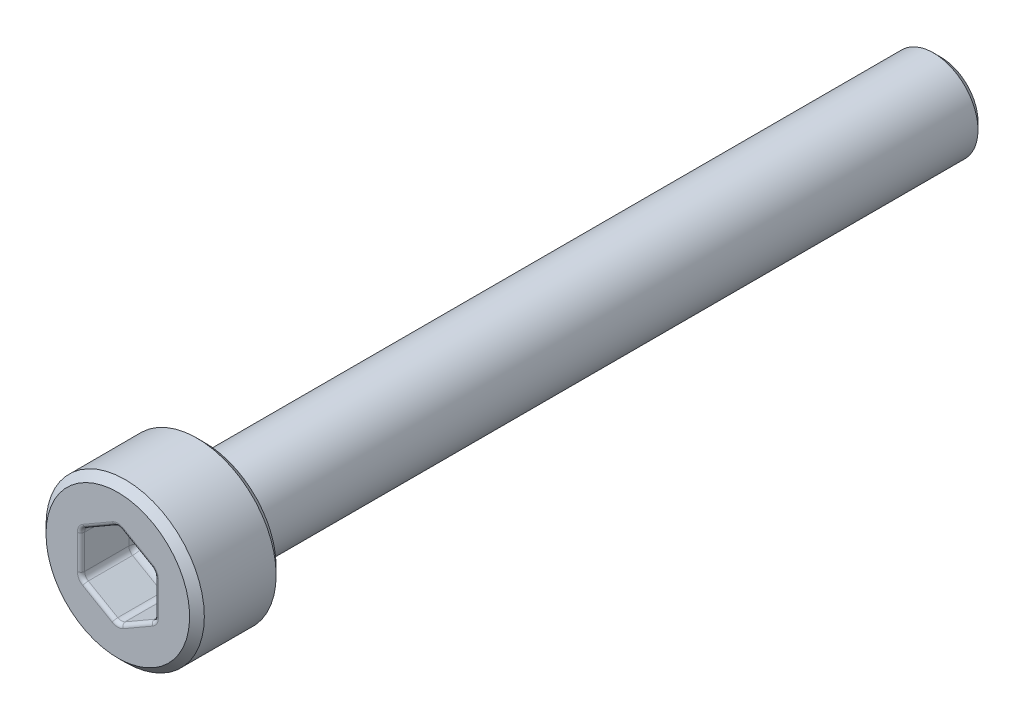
ISO-10303-21;
HEADER;
FILE_DESCRIPTION(('STEP AP214'),'2;1');
FILE_NAME('part.step','',(''),(''),'','','');
FILE_SCHEMA(('AUTOMOTIVE_DESIGN { 1 0 10303 214 1 1 1 1 }'));
ENDSEC;
DATA;
#1=APPLICATION_CONTEXT('core data for automotive mechanical design processes');
#2=APPLICATION_PROTOCOL_DEFINITION('international standard','automotive_design',2000,#1);
#3=PRODUCT_CONTEXT('',#1,'mechanical');
#4=PRODUCT('Part','Part','',(#3));
#5=PRODUCT_RELATED_PRODUCT_CATEGORY('part','',(#4));
#6=PRODUCT_DEFINITION_FORMATION('','',#4);
#7=PRODUCT_DEFINITION_CONTEXT('part definition',#1,'design');
#8=PRODUCT_DEFINITION('design','',#6,#7);
#9=PRODUCT_DEFINITION_SHAPE('','',#8);
#10=(LENGTH_UNIT() NAMED_UNIT(*) SI_UNIT(.MILLI.,.METRE.));
#11=(NAMED_UNIT(*) PLANE_ANGLE_UNIT() SI_UNIT($,.RADIAN.));
#12=(NAMED_UNIT(*) SI_UNIT($,.STERADIAN.) SOLID_ANGLE_UNIT());
#13=UNCERTAINTY_MEASURE_WITH_UNIT(LENGTH_MEASURE(1.E-05),#10,'distance_accuracy_value','');
#14=(GEOMETRIC_REPRESENTATION_CONTEXT(3) GLOBAL_UNCERTAINTY_ASSIGNED_CONTEXT((#13)) GLOBAL_UNIT_ASSIGNED_CONTEXT((#10,
#11,#12)) REPRESENTATION_CONTEXT('',''));
#15=CARTESIAN_POINT('',(0.,0.,0.));
#16=DIRECTION('',(0.,0.,1.));
#17=DIRECTION('',(1.,0.,0.));
#18=AXIS2_PLACEMENT_3D('',#15,#16,#17);
#19=CARTESIAN_POINT('',(0.,0.,2.35));
#20=DIRECTION('',(0.,0.,-1.));
#21=DIRECTION('',(-1.,0.,0.));
#22=AXIS2_PLACEMENT_3D('',#19,#20,#21);
#23=PLANE('',#22);
#24=DIRECTION('',(0.,1.,0.));
#25=VECTOR('',#24,1.);
#26=CARTESIAN_POINT('',(1.1,0.,2.35));
#27=LINE('',#26,#25);
#28=CARTESIAN_POINT('',(1.1,0.4618802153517,2.35));
#29=VERTEX_POINT('',#28);
#30=CARTESIAN_POINT('',(1.1,-0.461880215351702,2.35));
#31=VERTEX_POINT('',#30);
#32=EDGE_CURVE('E264',#29,#31,#27,.F.);
#33=ORIENTED_EDGE('',*,*,#32,.T.);
#34=CARTESIAN_POINT('',(0.8,-0.461880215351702,2.35));
#35=DIRECTION('',(0.,0.,-1.));
#36=DIRECTION('',(-1.,0.,0.));
#37=AXIS2_PLACEMENT_3D('',#34,#35,#36);
#38=CIRCLE('',#37,0.3);
#39=CARTESIAN_POINT('',(0.95,-0.721687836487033,2.35));
#40=VERTEX_POINT('',#39);
#41=EDGE_CURVE('E329',#31,#40,#38,.T.);
#42=ORIENTED_EDGE('',*,*,#41,.T.);
#43=DIRECTION('',(0.866025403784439,0.499999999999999,0.));
#44=VECTOR('',#43,1.);
#45=CARTESIAN_POINT('',(0.549999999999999,-0.952627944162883,2.35));
#46=LINE('',#45,#44);
#47=CARTESIAN_POINT('',(0.149999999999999,-1.18356805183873,2.35));
#48=VERTEX_POINT('',#47);
#49=EDGE_CURVE('E327',#40,#48,#46,.F.);
#50=ORIENTED_EDGE('',*,*,#49,.T.);
#51=CARTESIAN_POINT('',(0.,-0.923760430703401,2.35));
#52=DIRECTION('',(0.,0.,-1.));
#53=DIRECTION('',(-1.,0.,0.));
#54=AXIS2_PLACEMENT_3D('',#51,#52,#53);
#55=CIRCLE('',#54,0.3);
#56=CARTESIAN_POINT('',(-0.150000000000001,-1.18356805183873,2.35));
#57=VERTEX_POINT('',#56);
#58=EDGE_CURVE('E325',#48,#57,#55,.T.);
#59=ORIENTED_EDGE('',*,*,#58,.T.);
#60=DIRECTION('',(0.866025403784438,-0.500000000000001,0.));
#61=VECTOR('',#60,1.);
#62=CARTESIAN_POINT('',(-0.550000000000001,-0.952627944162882,2.35));
#63=LINE('',#62,#61);
#64=CARTESIAN_POINT('',(-0.950000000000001,-0.721687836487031,2.35));
#65=VERTEX_POINT('',#64);
#66=EDGE_CURVE('E323',#57,#65,#63,.F.);
#67=ORIENTED_EDGE('',*,*,#66,.T.);
#68=CARTESIAN_POINT('',(-0.800000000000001,-0.4618802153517,2.35));
#69=DIRECTION('',(0.,0.,-1.));
#70=DIRECTION('',(-1.,0.,0.));
#71=AXIS2_PLACEMENT_3D('',#68,#69,#70);
#72=CIRCLE('',#71,0.3);
#73=CARTESIAN_POINT('',(-1.1,-0.4618802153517,2.35));
#74=VERTEX_POINT('',#73);
#75=EDGE_CURVE('E321',#65,#74,#72,.T.);
#76=ORIENTED_EDGE('',*,*,#75,.T.);
#77=DIRECTION('',(0.,-1.,0.));
#78=VECTOR('',#77,1.);
#79=CARTESIAN_POINT('',(-1.1,0.,2.35));
#80=LINE('',#79,#78);
#81=CARTESIAN_POINT('',(-1.1,0.461880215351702,2.35));
#82=VERTEX_POINT('',#81);
#83=EDGE_CURVE('E319',#74,#82,#80,.F.);
#84=ORIENTED_EDGE('',*,*,#83,.T.);
#85=CARTESIAN_POINT('',(-0.8,0.461880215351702,2.35));
#86=DIRECTION('',(0.,0.,-1.));
#87=DIRECTION('',(-1.,0.,0.));
#88=AXIS2_PLACEMENT_3D('',#85,#86,#87);
#89=CIRCLE('',#88,0.3);
#90=CARTESIAN_POINT('',(-0.95,0.721687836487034,2.35));
#91=VERTEX_POINT('',#90);
#92=EDGE_CURVE('E317',#82,#91,#89,.T.);
#93=ORIENTED_EDGE('',*,*,#92,.T.);
#94=DIRECTION('',(-0.866025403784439,-0.499999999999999,0.));
#95=VECTOR('',#94,1.);
#96=CARTESIAN_POINT('',(-0.549999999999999,0.952627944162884,2.35));
#97=LINE('',#96,#95);
#98=CARTESIAN_POINT('',(-0.149999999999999,1.18356805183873,2.35));
#99=VERTEX_POINT('',#98);
#100=EDGE_CURVE('E315',#91,#99,#97,.F.);
#101=ORIENTED_EDGE('',*,*,#100,.T.);
#102=CARTESIAN_POINT('',(0.,0.923760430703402,2.35));
#103=DIRECTION('',(0.,0.,-1.));
#104=DIRECTION('',(-1.,0.,0.));
#105=AXIS2_PLACEMENT_3D('',#102,#103,#104);
#106=CIRCLE('',#105,0.3);
#107=CARTESIAN_POINT('',(0.150000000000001,1.18356805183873,2.35));
#108=VERTEX_POINT('',#107);
#109=EDGE_CURVE('E313',#99,#108,#106,.T.);
#110=ORIENTED_EDGE('',*,*,#109,.T.);
#111=DIRECTION('',(-0.866025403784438,0.500000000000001,0.));
#112=VECTOR('',#111,1.);
#113=CARTESIAN_POINT('',(0.550000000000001,0.952627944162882,2.35));
#114=LINE('',#113,#112);
#115=CARTESIAN_POINT('',(0.950000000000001,0.721687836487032,2.35));
#116=VERTEX_POINT('',#115);
#117=EDGE_CURVE('E311',#108,#116,#114,.F.);
#118=ORIENTED_EDGE('',*,*,#117,.T.);
#119=CARTESIAN_POINT('',(0.8,0.4618802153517,2.35));
#120=DIRECTION('',(0.,0.,-1.));
#121=DIRECTION('',(-1.,0.,0.));
#122=AXIS2_PLACEMENT_3D('',#119,#120,#121);
#123=CIRCLE('',#122,0.3);
#124=EDGE_CURVE('E309',#116,#29,#123,.T.);
#125=ORIENTED_EDGE('',*,*,#124,.T.);
#126=EDGE_LOOP('',(#33,#42,#50,#59,#67,#76,#84,#93,#101,#110,#118,#125));
#127=FACE_BOUND('',#126,.T.);
#128=CARTESIAN_POINT('',(0.,0.,2.35));
#129=DIRECTION('',(0.,0.,-1.));
#130=DIRECTION('',(-1.,0.,0.));
#131=AXIS2_PLACEMENT_3D('',#128,#129,#130);
#132=CIRCLE('',#131,1.95);
#133=CARTESIAN_POINT('',(-1.95,0.,2.35));
#134=VERTEX_POINT('',#133);
#135=EDGE_CURVE('E307',#134,#134,#132,.F.);
#136=ORIENTED_EDGE('',*,*,#135,.T.);
#137=EDGE_LOOP('',(#136));
#138=FACE_BOUND('',#137,.T.);
#139=ADVANCED_FACE('F35',(#127,#138),#23,.F.);
#140=CARTESIAN_POINT('',(0.,0.,21.9198795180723));
#141=DIRECTION('',(0.,0.,1.));
#142=DIRECTION('',(1.,0.,0.));
#143=AXIS2_PLACEMENT_3D('',#140,#141,#142);
#144=CYLINDRICAL_SURFACE('',#143,2.15);
#145=CARTESIAN_POINT('',(0.,0.,2.15));
#146=DIRECTION('',(0.,0.,-1.));
#147=DIRECTION('',(-1.,0.,0.));
#148=AXIS2_PLACEMENT_3D('',#145,#146,#147);
#149=CIRCLE('',#148,2.15);
#150=CARTESIAN_POINT('',(-2.15,0.,2.15));
#151=VERTEX_POINT('',#150);
#152=EDGE_CURVE('E869',#151,#151,#149,.T.);
#153=ORIENTED_EDGE('',*,*,#152,.T.);
#154=EDGE_LOOP('',(#153));
#155=FACE_BOUND('',#154,.T.);
#156=CARTESIAN_POINT('',(0.,0.,0.199999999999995));
#157=DIRECTION('',(0.,0.,1.));
#158=DIRECTION('',(1.,0.,0.));
#159=AXIS2_PLACEMENT_3D('',#156,#157,#158);
#160=CIRCLE('',#159,2.15);
#161=CARTESIAN_POINT('',(2.15,0.,0.199999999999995));
#162=VERTEX_POINT('',#161);
#163=EDGE_CURVE('E874',#162,#162,#160,.T.);
#164=ORIENTED_EDGE('',*,*,#163,.T.);
#165=EDGE_LOOP('',(#164));
#166=FACE_BOUND('',#165,.T.);
#167=ADVANCED_FACE('F428',(#155,#166),#144,.T.);
#168=CARTESIAN_POINT('',(0.,2.15,0.));
#169=DIRECTION('',(0.,0.,1.));
#170=DIRECTION('',(1.,0.,0.));
#171=AXIS2_PLACEMENT_3D('',#168,#169,#170);
#172=PLANE('',#171);
#173=CARTESIAN_POINT('',(0.,0.,0.));
#174=DIRECTION('',(0.,0.,1.));
#175=DIRECTION('',(1.,0.,0.));
#176=AXIS2_PLACEMENT_3D('',#173,#174,#175);
#177=CIRCLE('',#176,1.41);
#178=CARTESIAN_POINT('',(1.41,0.,0.));
#179=VERTEX_POINT('',#178);
#180=EDGE_CURVE('E259',#179,#179,#177,.T.);
#181=ORIENTED_EDGE('',*,*,#180,.T.);
#182=EDGE_LOOP('',(#181));
#183=FACE_BOUND('',#182,.T.);
#184=CARTESIAN_POINT('',(0.,0.,0.));
#185=DIRECTION('',(0.,0.,1.));
#186=DIRECTION('',(1.,0.,0.));
#187=AXIS2_PLACEMENT_3D('',#184,#185,#186);
#188=CIRCLE('',#187,1.95);
#189=CARTESIAN_POINT('',(1.95,0.,0.));
#190=VERTEX_POINT('',#189);
#191=EDGE_CURVE('E867',#190,#190,#188,.F.);
#192=ORIENTED_EDGE('',*,*,#191,.T.);
#193=EDGE_LOOP('',(#192));
#194=FACE_BOUND('',#193,.T.);
#195=ADVANCED_FACE('F434',(#183,#194),#172,.F.);
#196=CARTESIAN_POINT('',(0.,0.,21.9198795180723));
#197=DIRECTION('',(0.,0.,1.));
#198=DIRECTION('',(1.,0.,0.));
#199=AXIS2_PLACEMENT_3D('',#196,#197,#198);
#200=CYLINDRICAL_SURFACE('',#199,1.21);
#201=CARTESIAN_POINT('',(0.,0.,-0.200000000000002));
#202=DIRECTION('',(0.,0.,1.));
#203=DIRECTION('',(1.,0.,0.));
#204=AXIS2_PLACEMENT_3D('',#201,#202,#203);
#205=CIRCLE('',#204,1.21);
#206=CARTESIAN_POINT('',(1.21,0.,-0.200000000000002));
#207=VERTEX_POINT('',#206);
#208=EDGE_CURVE('E262',#207,#207,#205,.F.);
#209=ORIENTED_EDGE('',*,*,#208,.T.);
#210=EDGE_LOOP('',(#209));
#211=FACE_BOUND('',#210,.T.);
#212=CARTESIAN_POINT('',(0.,0.,-19.8));
#213=DIRECTION('',(0.,0.,1.));
#214=DIRECTION('',(1.,0.,0.));
#215=AXIS2_PLACEMENT_3D('',#212,#213,#214);
#216=CIRCLE('',#215,1.21);
#217=CARTESIAN_POINT('',(1.21,0.,-19.8));
#218=VERTEX_POINT('',#217);
#219=EDGE_CURVE('E868',#218,#218,#216,.T.);
#220=ORIENTED_EDGE('',*,*,#219,.T.);
#221=EDGE_LOOP('',(#220));
#222=FACE_BOUND('',#221,.T.);
#223=ADVANCED_FACE('F809',(#211,#222),#200,.T.);
#224=CARTESIAN_POINT('',(0.,1.21,-20.));
#225=DIRECTION('',(0.,0.,1.));
#226=DIRECTION('',(1.,0.,0.));
#227=AXIS2_PLACEMENT_3D('',#224,#225,#226);
#228=PLANE('',#227);
#229=CARTESIAN_POINT('',(0.,0.,-20.));
#230=DIRECTION('',(0.,0.,1.));
#231=DIRECTION('',(1.,0.,0.));
#232=AXIS2_PLACEMENT_3D('',#229,#230,#231);
#233=CIRCLE('',#232,1.01);
#234=CARTESIAN_POINT('',(1.01,0.,-20.));
#235=VERTEX_POINT('',#234);
#236=EDGE_CURVE('E209',#235,#235,#233,.F.);
#237=ORIENTED_EDGE('',*,*,#236,.T.);
#238=EDGE_LOOP('',(#237));
#239=FACE_BOUND('',#238,.T.);
#240=ADVANCED_FACE('F801',(#239),#228,.F.);
#241=CARTESIAN_POINT('',(0.,-1.15470053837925,0.849999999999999));
#242=DIRECTION('',(0.499999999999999,-0.866025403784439,0.));
#243=DIRECTION('',(0.866025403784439,0.499999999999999,0.));
#244=AXIS2_PLACEMENT_3D('',#241,#242,#243);
#245=PLANE('',#244);
#246=DIRECTION('',(0.,0.,1.));
#247=VECTOR('',#246,1.);
#248=CARTESIAN_POINT('',(0.0999999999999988,-1.09696551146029,2.35));
#249=LINE('',#248,#247);
#250=CARTESIAN_POINT('',(0.0999999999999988,-1.09696551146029,1.05));
#251=VERTEX_POINT('',#250);
#252=CARTESIAN_POINT('',(0.0999999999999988,-1.09696551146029,2.25));
#253=VERTEX_POINT('',#252);
#254=EDGE_CURVE('E256',#251,#253,#249,.T.);
#255=ORIENTED_EDGE('',*,*,#254,.T.);
#256=DIRECTION('',(0.866025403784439,0.499999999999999,0.));
#257=VECTOR('',#256,1.);
#258=CARTESIAN_POINT('',(0.,-1.15470053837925,2.25));
#259=LINE('',#258,#257);
#260=CARTESIAN_POINT('',(0.899999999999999,-0.635085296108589,2.25));
#261=VERTEX_POINT('',#260);
#262=EDGE_CURVE('E335',#253,#261,#259,.T.);
#263=ORIENTED_EDGE('',*,*,#262,.T.);
#264=DIRECTION('',(0.,0.,1.));
#265=VECTOR('',#264,1.);
#266=CARTESIAN_POINT('',(0.899999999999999,-0.635085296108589,0.849999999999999));
#267=LINE('',#266,#265);
#268=CARTESIAN_POINT('',(0.899999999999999,-0.635085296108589,1.05));
#269=VERTEX_POINT('',#268);
#270=EDGE_CURVE('E252',#261,#269,#267,.F.);
#271=ORIENTED_EDGE('',*,*,#270,.T.);
#272=DIRECTION('',(0.866025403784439,0.499999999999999,0.));
#273=VECTOR('',#272,1.);
#274=CARTESIAN_POINT('',(0.,-1.15470053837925,1.05));
#275=LINE('',#274,#273);
#276=EDGE_CURVE('E254',#269,#251,#275,.F.);
#277=ORIENTED_EDGE('',*,*,#276,.T.);
#278=EDGE_LOOP('',(#255,#263,#271,#277));
#279=FACE_BOUND('',#278,.T.);
#280=ADVANCED_FACE('F792',(#279),#245,.F.);
#281=CARTESIAN_POINT('',(-1.,-0.577350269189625,0.849999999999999));
#282=DIRECTION('',(-0.500000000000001,-0.866025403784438,0.));
#283=DIRECTION('',(0.866025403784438,-0.500000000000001,0.));
#284=AXIS2_PLACEMENT_3D('',#281,#282,#283);
#285=PLANE('',#284);
#286=DIRECTION('',(0.,0.,1.));
#287=VECTOR('',#286,1.);
#288=CARTESIAN_POINT('',(-0.900000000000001,-0.635085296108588,2.35));
#289=LINE('',#288,#287);
#290=CARTESIAN_POINT('',(-0.900000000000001,-0.635085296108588,1.05));
#291=VERTEX_POINT('',#290);
#292=CARTESIAN_POINT('',(-0.900000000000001,-0.635085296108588,2.25));
#293=VERTEX_POINT('',#292);
#294=EDGE_CURVE('E223',#291,#293,#289,.T.);
#295=ORIENTED_EDGE('',*,*,#294,.T.);
#296=DIRECTION('',(0.866025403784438,-0.500000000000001,0.));
#297=VECTOR('',#296,1.);
#298=CARTESIAN_POINT('',(-1.,-0.577350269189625,2.25));
#299=LINE('',#298,#297);
#300=CARTESIAN_POINT('',(-0.100000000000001,-1.09696551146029,2.25));
#301=VERTEX_POINT('',#300);
#302=EDGE_CURVE('E339',#293,#301,#299,.T.);
#303=ORIENTED_EDGE('',*,*,#302,.T.);
#304=DIRECTION('',(0.,0.,1.));
#305=VECTOR('',#304,1.);
#306=CARTESIAN_POINT('',(-0.100000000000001,-1.09696551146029,0.849999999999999));
#307=LINE('',#306,#305);
#308=CARTESIAN_POINT('',(-0.100000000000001,-1.09696551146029,1.05));
#309=VERTEX_POINT('',#308);
#310=EDGE_CURVE('E215',#301,#309,#307,.F.);
#311=ORIENTED_EDGE('',*,*,#310,.T.);
#312=DIRECTION('',(0.866025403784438,-0.500000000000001,0.));
#313=VECTOR('',#312,1.);
#314=CARTESIAN_POINT('',(-1.,-0.577350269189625,1.05));
#315=LINE('',#314,#313);
#316=EDGE_CURVE('E186',#309,#291,#315,.F.);
#317=ORIENTED_EDGE('',*,*,#316,.T.);
#318=EDGE_LOOP('',(#295,#303,#311,#317));
#319=FACE_BOUND('',#318,.T.);
#320=ADVANCED_FACE('F784',(#319),#285,.F.);
#321=CARTESIAN_POINT('',(-1.,0.577350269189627,0.849999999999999));
#322=DIRECTION('',(-1.,0.,0.));
#323=DIRECTION('',(0.,-1.,0.));
#324=AXIS2_PLACEMENT_3D('',#321,#322,#323);
#325=PLANE('',#324);
#326=DIRECTION('',(0.,0.,1.));
#327=VECTOR('',#326,1.);
#328=CARTESIAN_POINT('',(-1.,0.461880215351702,2.35));
#329=LINE('',#328,#327);
#330=CARTESIAN_POINT('',(-1.,0.461880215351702,1.05));
#331=VERTEX_POINT('',#330);
#332=CARTESIAN_POINT('',(-1.,0.461880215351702,2.25));
#333=VERTEX_POINT('',#332);
#334=EDGE_CURVE('E226',#331,#333,#329,.T.);
#335=ORIENTED_EDGE('',*,*,#334,.T.);
#336=DIRECTION('',(0.,-1.,0.));
#337=VECTOR('',#336,1.);
#338=CARTESIAN_POINT('',(-1.,0.577350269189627,2.25));
#339=LINE('',#338,#337);
#340=CARTESIAN_POINT('',(-1.,-0.4618802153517,2.25));
#341=VERTEX_POINT('',#340);
#342=EDGE_CURVE('E343',#333,#341,#339,.T.);
#343=ORIENTED_EDGE('',*,*,#342,.T.);
#344=DIRECTION('',(0.,0.,1.));
#345=VECTOR('',#344,1.);
#346=CARTESIAN_POINT('',(-1.,-0.4618802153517,0.849999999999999));
#347=LINE('',#346,#345);
#348=CARTESIAN_POINT('',(-1.,-0.4618802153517,1.05));
#349=VERTEX_POINT('',#348);
#350=EDGE_CURVE('E231',#341,#349,#347,.F.);
#351=ORIENTED_EDGE('',*,*,#350,.T.);
#352=DIRECTION('',(0.,-1.,0.));
#353=VECTOR('',#352,1.);
#354=CARTESIAN_POINT('',(-1.,0.577350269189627,1.05));
#355=LINE('',#354,#353);
#356=EDGE_CURVE('E229',#349,#331,#355,.F.);
#357=ORIENTED_EDGE('',*,*,#356,.T.);
#358=EDGE_LOOP('',(#335,#343,#351,#357));
#359=FACE_BOUND('',#358,.T.);
#360=ADVANCED_FACE('F403',(#359),#325,.F.);
#361=CARTESIAN_POINT('',(0.,1.15470053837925,0.849999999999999));
#362=DIRECTION('',(-0.499999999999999,0.866025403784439,0.));
#363=DIRECTION('',(-0.866025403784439,-0.499999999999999,0.));
#364=AXIS2_PLACEMENT_3D('',#361,#362,#363);
#365=PLANE('',#364);
#366=DIRECTION('',(0.,0.,1.));
#367=VECTOR('',#366,1.);
#368=CARTESIAN_POINT('',(-0.0999999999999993,1.09696551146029,2.35));
#369=LINE('',#368,#367);
#370=CARTESIAN_POINT('',(-0.0999999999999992,1.09696551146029,1.05));
#371=VERTEX_POINT('',#370);
#372=CARTESIAN_POINT('',(-0.0999999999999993,1.09696551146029,2.25));
#373=VERTEX_POINT('',#372);
#374=EDGE_CURVE('E237',#371,#373,#369,.T.);
#375=ORIENTED_EDGE('',*,*,#374,.T.);
#376=DIRECTION('',(-0.866025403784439,-0.499999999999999,0.));
#377=VECTOR('',#376,1.);
#378=CARTESIAN_POINT('',(0.,1.15470053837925,2.25));
#379=LINE('',#378,#377);
#380=CARTESIAN_POINT('',(-0.9,0.63508529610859,2.25));
#381=VERTEX_POINT('',#380);
#382=EDGE_CURVE('E347',#373,#381,#379,.T.);
#383=ORIENTED_EDGE('',*,*,#382,.T.);
#384=DIRECTION('',(0.,0.,1.));
#385=VECTOR('',#384,1.);
#386=CARTESIAN_POINT('',(-0.9,0.63508529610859,0.849999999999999));
#387=LINE('',#386,#385);
#388=CARTESIAN_POINT('',(-0.9,0.63508529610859,1.05));
#389=VERTEX_POINT('',#388);
#390=EDGE_CURVE('E233',#381,#389,#387,.F.);
#391=ORIENTED_EDGE('',*,*,#390,.T.);
#392=DIRECTION('',(-0.866025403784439,-0.499999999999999,0.));
#393=VECTOR('',#392,1.);
#394=CARTESIAN_POINT('',(0.,1.15470053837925,1.05));
#395=LINE('',#394,#393);
#396=EDGE_CURVE('E235',#389,#371,#395,.F.);
#397=ORIENTED_EDGE('',*,*,#396,.T.);
#398=EDGE_LOOP('',(#375,#383,#391,#397));
#399=FACE_BOUND('',#398,.T.);
#400=ADVANCED_FACE('F767',(#399),#365,.F.);
#401=CARTESIAN_POINT('',(1.,0.577350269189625,0.849999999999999));
#402=DIRECTION('',(0.500000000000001,0.866025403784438,0.));
#403=DIRECTION('',(-0.866025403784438,0.500000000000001,0.));
#404=AXIS2_PLACEMENT_3D('',#401,#402,#403);
#405=PLANE('',#404);
#406=DIRECTION('',(0.,0.,1.));
#407=VECTOR('',#406,1.);
#408=CARTESIAN_POINT('',(0.9,0.635085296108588,2.35));
#409=LINE('',#408,#407);
#410=CARTESIAN_POINT('',(0.9,0.635085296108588,1.05));
#411=VERTEX_POINT('',#410);
#412=CARTESIAN_POINT('',(0.9,0.635085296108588,2.25));
#413=VERTEX_POINT('',#412);
#414=EDGE_CURVE('E244',#411,#413,#409,.T.);
#415=ORIENTED_EDGE('',*,*,#414,.T.);
#416=DIRECTION('',(-0.866025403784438,0.500000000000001,0.));
#417=VECTOR('',#416,1.);
#418=CARTESIAN_POINT('',(1.,0.577350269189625,2.25));
#419=LINE('',#418,#417);
#420=CARTESIAN_POINT('',(0.100000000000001,1.09696551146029,2.25));
#421=VERTEX_POINT('',#420);
#422=EDGE_CURVE('E351',#413,#421,#419,.T.);
#423=ORIENTED_EDGE('',*,*,#422,.T.);
#424=DIRECTION('',(0.,0.,1.));
#425=VECTOR('',#424,1.);
#426=CARTESIAN_POINT('',(0.100000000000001,1.09696551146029,0.849999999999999));
#427=LINE('',#426,#425);
#428=CARTESIAN_POINT('',(0.100000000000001,1.09696551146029,1.05));
#429=VERTEX_POINT('',#428);
#430=EDGE_CURVE('E240',#421,#429,#427,.F.);
#431=ORIENTED_EDGE('',*,*,#430,.T.);
#432=DIRECTION('',(-0.866025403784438,0.500000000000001,0.));
#433=VECTOR('',#432,1.);
#434=CARTESIAN_POINT('',(1.,0.577350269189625,1.05));
#435=LINE('',#434,#433);
#436=EDGE_CURVE('E242',#429,#411,#435,.F.);
#437=ORIENTED_EDGE('',*,*,#436,.T.);
#438=EDGE_LOOP('',(#415,#423,#431,#437));
#439=FACE_BOUND('',#438,.T.);
#440=ADVANCED_FACE('F759',(#439),#405,.F.);
#441=CARTESIAN_POINT('',(1.,-0.577350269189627,0.849999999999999));
#442=DIRECTION('',(1.,0.,0.));
#443=DIRECTION('',(0.,1.,0.));
#444=AXIS2_PLACEMENT_3D('',#441,#442,#443);
#445=PLANE('',#444);
#446=DIRECTION('',(0.,0.,1.));
#447=VECTOR('',#446,1.);
#448=CARTESIAN_POINT('',(1.,-0.461880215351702,2.35));
#449=LINE('',#448,#447);
#450=CARTESIAN_POINT('',(1.,-0.461880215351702,1.05));
#451=VERTEX_POINT('',#450);
#452=CARTESIAN_POINT('',(1.,-0.461880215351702,2.25));
#453=VERTEX_POINT('',#452);
#454=EDGE_CURVE('E250',#451,#453,#449,.T.);
#455=ORIENTED_EDGE('',*,*,#454,.T.);
#456=DIRECTION('',(0.,1.,0.));
#457=VECTOR('',#456,1.);
#458=CARTESIAN_POINT('',(1.,-0.577350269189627,2.25));
#459=LINE('',#458,#457);
#460=CARTESIAN_POINT('',(1.,0.4618802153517,2.25));
#461=VERTEX_POINT('',#460);
#462=EDGE_CURVE('E11',#453,#461,#459,.T.);
#463=ORIENTED_EDGE('',*,*,#462,.T.);
#464=DIRECTION('',(0.,0.,1.));
#465=VECTOR('',#464,1.);
#466=CARTESIAN_POINT('',(1.,0.4618802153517,0.849999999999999));
#467=LINE('',#466,#465);
#468=CARTESIAN_POINT('',(1.,0.4618802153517,1.05));
#469=VERTEX_POINT('',#468);
#470=EDGE_CURVE('E246',#461,#469,#467,.F.);
#471=ORIENTED_EDGE('',*,*,#470,.T.);
#472=DIRECTION('',(0.,1.,0.));
#473=VECTOR('',#472,1.);
#474=CARTESIAN_POINT('',(1.,-0.577350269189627,1.05));
#475=LINE('',#474,#473);
#476=EDGE_CURVE('E248',#469,#451,#475,.F.);
#477=ORIENTED_EDGE('',*,*,#476,.T.);
#478=EDGE_LOOP('',(#455,#463,#471,#477));
#479=FACE_BOUND('',#478,.T.);
#480=ADVANCED_FACE('F751',(#479),#445,.F.);
#481=CARTESIAN_POINT('',(0.,0.,0.849999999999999));
#482=DIRECTION('',(0.,0.,1.));
#483=DIRECTION('',(1.,0.,0.));
#484=AXIS2_PLACEMENT_3D('',#481,#482,#483);
#485=PLANE('',#484);
#486=DIRECTION('',(0.,-1.,0.));
#487=VECTOR('',#486,1.);
#488=CARTESIAN_POINT('',(-0.8,0.,0.849999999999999));
#489=LINE('',#488,#487);
#490=CARTESIAN_POINT('',(-0.8,0.461880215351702,0.849999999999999));
#491=VERTEX_POINT('',#490);
#492=CARTESIAN_POINT('',(-0.800000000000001,-0.4618802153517,0.849999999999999));
#493=VERTEX_POINT('',#492);
#494=EDGE_CURVE('E213',#491,#493,#489,.T.);
#495=ORIENTED_EDGE('',*,*,#494,.T.);
#496=DIRECTION('',(0.866025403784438,-0.500000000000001,0.));
#497=VECTOR('',#496,1.);
#498=CARTESIAN_POINT('',(-0.400000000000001,-0.692820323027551,0.849999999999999));
#499=LINE('',#498,#497);
#500=CARTESIAN_POINT('',(0.,-0.923760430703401,0.849999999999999));
#501=VERTEX_POINT('',#500);
#502=EDGE_CURVE('E184',#493,#501,#499,.T.);
#503=ORIENTED_EDGE('',*,*,#502,.T.);
#504=DIRECTION('',(0.866025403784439,0.499999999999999,0.));
#505=VECTOR('',#504,1.);
#506=CARTESIAN_POINT('',(0.399999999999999,-0.692820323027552,0.849999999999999));
#507=LINE('',#506,#505);
#508=CARTESIAN_POINT('',(0.8,-0.461880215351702,0.849999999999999));
#509=VERTEX_POINT('',#508);
#510=EDGE_CURVE('E202',#501,#509,#507,.T.);
#511=ORIENTED_EDGE('',*,*,#510,.T.);
#512=DIRECTION('',(0.,1.,0.));
#513=VECTOR('',#512,1.);
#514=CARTESIAN_POINT('',(0.8,0.,0.849999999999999));
#515=LINE('',#514,#513);
#516=CARTESIAN_POINT('',(0.8,0.4618802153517,0.849999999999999));
#517=VERTEX_POINT('',#516);
#518=EDGE_CURVE('E208',#509,#517,#515,.T.);
#519=ORIENTED_EDGE('',*,*,#518,.T.);
#520=DIRECTION('',(-0.866025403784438,0.500000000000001,0.));
#521=VECTOR('',#520,1.);
#522=CARTESIAN_POINT('',(0.400000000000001,0.692820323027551,0.849999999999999));
#523=LINE('',#522,#521);
#524=CARTESIAN_POINT('',(0.,0.923760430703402,0.849999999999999));
#525=VERTEX_POINT('',#524);
#526=EDGE_CURVE('E881',#517,#525,#523,.T.);
#527=ORIENTED_EDGE('',*,*,#526,.T.);
#528=DIRECTION('',(-0.866025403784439,-0.499999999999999,0.));
#529=VECTOR('',#528,1.);
#530=CARTESIAN_POINT('',(-0.4,0.692820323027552,0.849999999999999));
#531=LINE('',#530,#529);
#532=EDGE_CURVE('E218',#525,#491,#531,.T.);
#533=ORIENTED_EDGE('',*,*,#532,.T.);
#534=EDGE_LOOP('',(#495,#503,#511,#519,#527,#533));
#535=FACE_BOUND('',#534,.T.);
#536=ADVANCED_FACE('F211',(#535),#485,.T.);
#537=CARTESIAN_POINT('',(0.,0.,2.35));
#538=DIRECTION('',(0.,0.,-1.));
#539=DIRECTION('',(-1.,0.,0.));
#540=AXIS2_PLACEMENT_3D('',#537,#538,#539);
#541=CONICAL_SURFACE('',#540,1.95,0.78539816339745);
#542=ORIENTED_EDGE('',*,*,#152,.F.);
#543=EDGE_LOOP('',(#542));
#544=FACE_BOUND('',#543,.T.);
#545=ORIENTED_EDGE('',*,*,#135,.F.);
#546=EDGE_LOOP('',(#545));
#547=FACE_BOUND('',#546,.T.);
#548=ADVANCED_FACE('F440',(#544,#547),#541,.T.);
#549=CARTESIAN_POINT('',(0.,0.,0.199999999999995));
#550=DIRECTION('',(0.,0.,1.));
#551=DIRECTION('',(1.,0.,0.));
#552=AXIS2_PLACEMENT_3D('',#549,#550,#551);
#553=CONICAL_SURFACE('',#552,2.15,0.785398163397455);
#554=ORIENTED_EDGE('',*,*,#191,.F.);
#555=EDGE_LOOP('',(#554));
#556=FACE_BOUND('',#555,.T.);
#557=ORIENTED_EDGE('',*,*,#163,.F.);
#558=EDGE_LOOP('',(#557));
#559=FACE_BOUND('',#558,.T.);
#560=ADVANCED_FACE('F443',(#556,#559),#553,.T.);
#561=CARTESIAN_POINT('',(0.,0.,-19.8));
#562=DIRECTION('',(0.,0.,1.));
#563=DIRECTION('',(1.,0.,0.));
#564=AXIS2_PLACEMENT_3D('',#561,#562,#563);
#565=CONICAL_SURFACE('',#564,1.21,0.785398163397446);
#566=ORIENTED_EDGE('',*,*,#236,.F.);
#567=EDGE_LOOP('',(#566));
#568=FACE_BOUND('',#567,.T.);
#569=ORIENTED_EDGE('',*,*,#219,.F.);
#570=EDGE_LOOP('',(#569));
#571=FACE_BOUND('',#570,.T.);
#572=ADVANCED_FACE('F447',(#568,#571),#565,.T.);
#573=CARTESIAN_POINT('',(0.,0.923760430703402,0.849999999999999));
#574=DIRECTION('',(0.,0.,-1.));
#575=DIRECTION('',(-1.,0.,0.));
#576=AXIS2_PLACEMENT_3D('',#573,#574,#575);
#577=CYLINDRICAL_SURFACE('',#576,0.2);
#578=ORIENTED_EDGE('',*,*,#430,.F.);
#579=CARTESIAN_POINT('',(0.,0.923760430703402,2.25));
#580=DIRECTION('',(0.,0.,-1.));
#581=DIRECTION('',(-1.,0.,0.));
#582=AXIS2_PLACEMENT_3D('',#579,#580,#581);
#583=CIRCLE('',#582,0.2);
#584=EDGE_CURVE('E349',#421,#373,#583,.F.);
#585=ORIENTED_EDGE('',*,*,#584,.T.);
#586=ORIENTED_EDGE('',*,*,#374,.F.);
#587=CARTESIAN_POINT('',(0.,0.923760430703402,1.05));
#588=DIRECTION('',(0.,0.,1.));
#589=DIRECTION('',(1.,0.,0.));
#590=AXIS2_PLACEMENT_3D('',#587,#588,#589);
#591=CIRCLE('',#590,0.2);
#592=EDGE_CURVE('E304',#429,#371,#591,.T.);
#593=ORIENTED_EDGE('',*,*,#592,.F.);
#594=EDGE_LOOP('',(#578,#585,#586,#593));
#595=FACE_BOUND('',#594,.T.);
#596=ADVANCED_FACE('F451',(#595),#577,.F.);
#597=CARTESIAN_POINT('',(0.400000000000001,0.692820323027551,1.05));
#598=DIRECTION('',(-0.866025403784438,0.500000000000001,0.));
#599=DIRECTION('',(-0.500000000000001,-0.866025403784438,0.));
#600=AXIS2_PLACEMENT_3D('',#597,#598,#599);
#601=CYLINDRICAL_SURFACE('',#600,0.2);
#602=CARTESIAN_POINT('',(0.8,0.4618802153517,1.05));
#603=DIRECTION('',(-0.866025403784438,0.500000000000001,0.));
#604=DIRECTION('',(-0.500000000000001,-0.866025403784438,0.));
#605=AXIS2_PLACEMENT_3D('',#602,#603,#604);
#606=CIRCLE('',#605,0.2);
#607=EDGE_CURVE('E298',#411,#517,#606,.T.);
#608=ORIENTED_EDGE('',*,*,#607,.F.);
#609=ORIENTED_EDGE('',*,*,#436,.F.);
#610=CARTESIAN_POINT('',(0.,0.923760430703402,1.05));
#611=DIRECTION('',(0.866025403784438,-0.500000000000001,0.));
#612=DIRECTION('',(0.500000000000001,0.866025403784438,0.));
#613=AXIS2_PLACEMENT_3D('',#610,#611,#612);
#614=CIRCLE('',#613,0.2);
#615=EDGE_CURVE('E301',#525,#429,#614,.T.);
#616=ORIENTED_EDGE('',*,*,#615,.F.);
#617=ORIENTED_EDGE('',*,*,#526,.F.);
#618=EDGE_LOOP('',(#608,#609,#616,#617));
#619=FACE_BOUND('',#618,.T.);
#620=ADVANCED_FACE('F712',(#619),#601,.F.);
#621=CARTESIAN_POINT('',(0.8,0.4618802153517,0.849999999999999));
#622=DIRECTION('',(0.,0.,-1.));
#623=DIRECTION('',(-1.,0.,0.));
#624=AXIS2_PLACEMENT_3D('',#621,#622,#623);
#625=CYLINDRICAL_SURFACE('',#624,0.2);
#626=ORIENTED_EDGE('',*,*,#470,.F.);
#627=CARTESIAN_POINT('',(0.8,0.4618802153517,2.25));
#628=DIRECTION('',(0.,0.,-1.));
#629=DIRECTION('',(-1.,0.,0.));
#630=AXIS2_PLACEMENT_3D('',#627,#628,#629);
#631=CIRCLE('',#630,0.2);
#632=EDGE_CURVE('E44',#461,#413,#631,.F.);
#633=ORIENTED_EDGE('',*,*,#632,.T.);
#634=ORIENTED_EDGE('',*,*,#414,.F.);
#635=CARTESIAN_POINT('',(0.8,0.4618802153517,1.05));
#636=DIRECTION('',(0.,0.,1.));
#637=DIRECTION('',(1.,0.,0.));
#638=AXIS2_PLACEMENT_3D('',#635,#636,#637);
#639=CIRCLE('',#638,0.2);
#640=EDGE_CURVE('E295',#469,#411,#639,.T.);
#641=ORIENTED_EDGE('',*,*,#640,.F.);
#642=EDGE_LOOP('',(#626,#633,#634,#641));
#643=FACE_BOUND('',#642,.T.);
#644=ADVANCED_FACE('F703',(#643),#625,.F.);
#645=CARTESIAN_POINT('',(0.,0.923760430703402,1.05));
#646=DIRECTION('',(0.,0.,1.));
#647=DIRECTION('',(1.,0.,0.));
#648=AXIS2_PLACEMENT_3D('',#645,#646,#647);
#649=SPHERICAL_SURFACE('',#648,0.2);
#650=ORIENTED_EDGE('',*,*,#615,.T.);
#651=ORIENTED_EDGE('',*,*,#592,.T.);
#652=CARTESIAN_POINT('',(0.,0.923760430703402,1.05));
#653=DIRECTION('',(-0.866025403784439,-0.499999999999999,0.));
#654=DIRECTION('',(0.499999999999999,-0.866025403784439,0.));
#655=AXIS2_PLACEMENT_3D('',#652,#653,#654);
#656=CIRCLE('',#655,0.2);
#657=EDGE_CURVE('E292',#525,#371,#656,.F.);
#658=ORIENTED_EDGE('',*,*,#657,.F.);
#659=EDGE_LOOP('',(#650,#651,#658));
#660=FACE_BOUND('',#659,.T.);
#661=ADVANCED_FACE('F694',(#660),#649,.F.);
#662=CARTESIAN_POINT('',(0.8,0.4618802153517,1.05));
#663=DIRECTION('',(0.,0.,1.));
#664=DIRECTION('',(1.,0.,0.));
#665=AXIS2_PLACEMENT_3D('',#662,#663,#664);
#666=SPHERICAL_SURFACE('',#665,0.2);
#667=ORIENTED_EDGE('',*,*,#640,.T.);
#668=ORIENTED_EDGE('',*,*,#607,.T.);
#669=CARTESIAN_POINT('',(0.8,0.4618802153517,1.05));
#670=DIRECTION('',(0.,-1.,0.));
#671=DIRECTION('',(1.,0.,0.));
#672=AXIS2_PLACEMENT_3D('',#669,#670,#671);
#673=CIRCLE('',#672,0.2);
#674=EDGE_CURVE('E289',#469,#517,#673,.F.);
#675=ORIENTED_EDGE('',*,*,#674,.F.);
#676=EDGE_LOOP('',(#667,#668,#675));
#677=FACE_BOUND('',#676,.T.);
#678=ADVANCED_FACE('F686',(#677),#666,.F.);
#679=CARTESIAN_POINT('',(-0.8,0.461880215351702,0.849999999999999));
#680=DIRECTION('',(0.,0.,-1.));
#681=DIRECTION('',(-1.,0.,0.));
#682=AXIS2_PLACEMENT_3D('',#679,#680,#681);
#683=CYLINDRICAL_SURFACE('',#682,0.2);
#684=ORIENTED_EDGE('',*,*,#390,.F.);
#685=CARTESIAN_POINT('',(-0.8,0.461880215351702,2.25));
#686=DIRECTION('',(0.,0.,-1.));
#687=DIRECTION('',(-1.,0.,0.));
#688=AXIS2_PLACEMENT_3D('',#685,#686,#687);
#689=CIRCLE('',#688,0.2);
#690=EDGE_CURVE('E345',#381,#333,#689,.F.);
#691=ORIENTED_EDGE('',*,*,#690,.T.);
#692=ORIENTED_EDGE('',*,*,#334,.F.);
#693=CARTESIAN_POINT('',(-0.8,0.461880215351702,1.05));
#694=DIRECTION('',(0.,0.,1.));
#695=DIRECTION('',(1.,0.,0.));
#696=AXIS2_PLACEMENT_3D('',#693,#694,#695);
#697=CIRCLE('',#696,0.2);
#698=EDGE_CURVE('E286',#389,#331,#697,.T.);
#699=ORIENTED_EDGE('',*,*,#698,.F.);
#700=EDGE_LOOP('',(#684,#691,#692,#699));
#701=FACE_BOUND('',#700,.T.);
#702=ADVANCED_FACE('F400',(#701),#683,.F.);
#703=CARTESIAN_POINT('',(-0.4,0.692820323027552,1.05));
#704=DIRECTION('',(-0.866025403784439,-0.499999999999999,0.));
#705=DIRECTION('',(0.499999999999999,-0.866025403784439,0.));
#706=AXIS2_PLACEMENT_3D('',#703,#704,#705);
#707=CYLINDRICAL_SURFACE('',#706,0.2);
#708=ORIENTED_EDGE('',*,*,#657,.T.);
#709=ORIENTED_EDGE('',*,*,#396,.F.);
#710=CARTESIAN_POINT('',(-0.8,0.461880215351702,1.05));
#711=DIRECTION('',(0.866025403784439,0.499999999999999,0.));
#712=DIRECTION('',(-0.499999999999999,0.866025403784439,0.));
#713=AXIS2_PLACEMENT_3D('',#710,#711,#712);
#714=CIRCLE('',#713,0.2);
#715=EDGE_CURVE('E283',#491,#389,#714,.T.);
#716=ORIENTED_EDGE('',*,*,#715,.F.);
#717=ORIENTED_EDGE('',*,*,#532,.F.);
#718=EDGE_LOOP('',(#708,#709,#716,#717));
#719=FACE_BOUND('',#718,.T.);
#720=ADVANCED_FACE('F669',(#719),#707,.F.);
#721=CARTESIAN_POINT('',(0.8,0.,1.05));
#722=DIRECTION('',(0.,1.,0.));
#723=DIRECTION('',(-1.,0.,0.));
#724=AXIS2_PLACEMENT_3D('',#721,#722,#723);
#725=CYLINDRICAL_SURFACE('',#724,0.2);
#726=ORIENTED_EDGE('',*,*,#674,.T.);
#727=ORIENTED_EDGE('',*,*,#518,.F.);
#728=CARTESIAN_POINT('',(0.8,-0.461880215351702,1.05));
#729=DIRECTION('',(0.,1.,0.));
#730=DIRECTION('',(-1.,0.,0.));
#731=AXIS2_PLACEMENT_3D('',#728,#729,#730);
#732=CIRCLE('',#731,0.2);
#733=EDGE_CURVE('E280',#451,#509,#732,.T.);
#734=ORIENTED_EDGE('',*,*,#733,.F.);
#735=ORIENTED_EDGE('',*,*,#476,.F.);
#736=EDGE_LOOP('',(#726,#727,#734,#735));
#737=FACE_BOUND('',#736,.T.);
#738=ADVANCED_FACE('F660',(#737),#725,.F.);
#739=CARTESIAN_POINT('',(0.8,-0.461880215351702,0.849999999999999));
#740=DIRECTION('',(0.,0.,-1.));
#741=DIRECTION('',(-1.,0.,0.));
#742=AXIS2_PLACEMENT_3D('',#739,#740,#741);
#743=CYLINDRICAL_SURFACE('',#742,0.2);
#744=ORIENTED_EDGE('',*,*,#270,.F.);
#745=CARTESIAN_POINT('',(0.8,-0.461880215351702,2.25));
#746=DIRECTION('',(0.,0.,-1.));
#747=DIRECTION('',(-1.,0.,0.));
#748=AXIS2_PLACEMENT_3D('',#745,#746,#747);
#749=CIRCLE('',#748,0.2);
#750=EDGE_CURVE('E332',#261,#453,#749,.F.);
#751=ORIENTED_EDGE('',*,*,#750,.T.);
#752=ORIENTED_EDGE('',*,*,#454,.F.);
#753=CARTESIAN_POINT('',(0.8,-0.461880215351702,1.05));
#754=DIRECTION('',(0.,0.,1.));
#755=DIRECTION('',(1.,0.,0.));
#756=AXIS2_PLACEMENT_3D('',#753,#754,#755);
#757=CIRCLE('',#756,0.2);
#758=EDGE_CURVE('E277',#269,#451,#757,.T.);
#759=ORIENTED_EDGE('',*,*,#758,.F.);
#760=EDGE_LOOP('',(#744,#751,#752,#759));
#761=FACE_BOUND('',#760,.T.);
#762=ADVANCED_FACE('F651',(#761),#743,.F.);
#763=CARTESIAN_POINT('',(-0.8,0.461880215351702,1.05));
#764=DIRECTION('',(0.,0.,1.));
#765=DIRECTION('',(1.,0.,0.));
#766=AXIS2_PLACEMENT_3D('',#763,#764,#765);
#767=SPHERICAL_SURFACE('',#766,0.2);
#768=ORIENTED_EDGE('',*,*,#715,.T.);
#769=ORIENTED_EDGE('',*,*,#698,.T.);
#770=CARTESIAN_POINT('',(-0.8,0.461880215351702,1.05));
#771=DIRECTION('',(0.,-1.,0.));
#772=DIRECTION('',(1.,0.,0.));
#773=AXIS2_PLACEMENT_3D('',#770,#771,#772);
#774=CIRCLE('',#773,0.2);
#775=EDGE_CURVE('E274',#491,#331,#774,.F.);
#776=ORIENTED_EDGE('',*,*,#775,.F.);
#777=EDGE_LOOP('',(#768,#769,#776));
#778=FACE_BOUND('',#777,.T.);
#779=ADVANCED_FACE('F642',(#778),#767,.F.);
#780=CARTESIAN_POINT('',(0.8,-0.461880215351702,1.05));
#781=DIRECTION('',(0.,0.,1.));
#782=DIRECTION('',(1.,0.,0.));
#783=AXIS2_PLACEMENT_3D('',#780,#781,#782);
#784=SPHERICAL_SURFACE('',#783,0.2);
#785=ORIENTED_EDGE('',*,*,#758,.T.);
#786=ORIENTED_EDGE('',*,*,#733,.T.);
#787=CARTESIAN_POINT('',(0.8,-0.461880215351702,1.05));
#788=DIRECTION('',(-0.866025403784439,-0.499999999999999,0.));
#789=DIRECTION('',(0.499999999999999,-0.866025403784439,0.));
#790=AXIS2_PLACEMENT_3D('',#787,#788,#789);
#791=CIRCLE('',#790,0.2);
#792=EDGE_CURVE('E205',#269,#509,#791,.F.);
#793=ORIENTED_EDGE('',*,*,#792,.F.);
#794=EDGE_LOOP('',(#785,#786,#793));
#795=FACE_BOUND('',#794,.T.);
#796=ADVANCED_FACE('F634',(#795),#784,.F.);
#797=CARTESIAN_POINT('',(-0.800000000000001,-0.4618802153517,0.849999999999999));
#798=DIRECTION('',(0.,0.,-1.));
#799=DIRECTION('',(-1.,0.,0.));
#800=AXIS2_PLACEMENT_3D('',#797,#798,#799);
#801=CYLINDRICAL_SURFACE('',#800,0.2);
#802=ORIENTED_EDGE('',*,*,#350,.F.);
#803=CARTESIAN_POINT('',(-0.800000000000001,-0.4618802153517,2.25));
#804=DIRECTION('',(0.,0.,-1.));
#805=DIRECTION('',(-1.,0.,0.));
#806=AXIS2_PLACEMENT_3D('',#803,#804,#805);
#807=CIRCLE('',#806,0.2);
#808=EDGE_CURVE('E341',#341,#293,#807,.F.);
#809=ORIENTED_EDGE('',*,*,#808,.T.);
#810=ORIENTED_EDGE('',*,*,#294,.F.);
#811=CARTESIAN_POINT('',(-0.800000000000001,-0.4618802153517,1.05));
#812=DIRECTION('',(0.,0.,1.));
#813=DIRECTION('',(1.,0.,0.));
#814=AXIS2_PLACEMENT_3D('',#811,#812,#813);
#815=CIRCLE('',#814,0.2);
#816=EDGE_CURVE('E270',#349,#291,#815,.T.);
#817=ORIENTED_EDGE('',*,*,#816,.F.);
#818=EDGE_LOOP('',(#802,#809,#810,#817));
#819=FACE_BOUND('',#818,.T.);
#820=ADVANCED_FACE('F413',(#819),#801,.F.);
#821=CARTESIAN_POINT('',(-0.8,0.,1.05));
#822=DIRECTION('',(0.,-1.,0.));
#823=DIRECTION('',(1.,0.,0.));
#824=AXIS2_PLACEMENT_3D('',#821,#822,#823);
#825=CYLINDRICAL_SURFACE('',#824,0.2);
#826=ORIENTED_EDGE('',*,*,#775,.T.);
#827=ORIENTED_EDGE('',*,*,#356,.F.);
#828=CARTESIAN_POINT('',(-0.800000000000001,-0.4618802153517,1.05));
#829=DIRECTION('',(0.,1.,0.));
#830=DIRECTION('',(-1.,0.,0.));
#831=AXIS2_PLACEMENT_3D('',#828,#829,#830);
#832=CIRCLE('',#831,0.2);
#833=EDGE_CURVE('E199',#493,#349,#832,.T.);
#834=ORIENTED_EDGE('',*,*,#833,.F.);
#835=ORIENTED_EDGE('',*,*,#494,.F.);
#836=EDGE_LOOP('',(#826,#827,#834,#835));
#837=FACE_BOUND('',#836,.T.);
#838=ADVANCED_FACE('F408',(#837),#825,.F.);
#839=CARTESIAN_POINT('',(0.399999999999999,-0.692820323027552,1.05));
#840=DIRECTION('',(0.866025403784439,0.499999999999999,0.));
#841=DIRECTION('',(-0.499999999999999,0.866025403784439,0.));
#842=AXIS2_PLACEMENT_3D('',#839,#840,#841);
#843=CYLINDRICAL_SURFACE('',#842,0.2);
#844=ORIENTED_EDGE('',*,*,#792,.T.);
#845=ORIENTED_EDGE('',*,*,#510,.F.);
#846=CARTESIAN_POINT('',(0.,-0.923760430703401,1.05));
#847=DIRECTION('',(0.866025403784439,0.499999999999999,0.));
#848=DIRECTION('',(-0.499999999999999,0.866025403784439,0.));
#849=AXIS2_PLACEMENT_3D('',#846,#847,#848);
#850=CIRCLE('',#849,0.2);
#851=EDGE_CURVE('E192',#251,#501,#850,.T.);
#852=ORIENTED_EDGE('',*,*,#851,.F.);
#853=ORIENTED_EDGE('',*,*,#276,.F.);
#854=EDGE_LOOP('',(#844,#845,#852,#853));
#855=FACE_BOUND('',#854,.T.);
#856=ADVANCED_FACE('F203',(#855),#843,.F.);
#857=CARTESIAN_POINT('',(0.,-0.923760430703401,0.849999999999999));
#858=DIRECTION('',(0.,0.,-1.));
#859=DIRECTION('',(-1.,0.,0.));
#860=AXIS2_PLACEMENT_3D('',#857,#858,#859);
#861=CYLINDRICAL_SURFACE('',#860,0.2);
#862=ORIENTED_EDGE('',*,*,#310,.F.);
#863=CARTESIAN_POINT('',(0.,-0.923760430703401,2.25));
#864=DIRECTION('',(0.,0.,-1.));
#865=DIRECTION('',(-1.,0.,0.));
#866=AXIS2_PLACEMENT_3D('',#863,#864,#865);
#867=CIRCLE('',#866,0.2);
#868=EDGE_CURVE('E337',#301,#253,#867,.F.);
#869=ORIENTED_EDGE('',*,*,#868,.T.);
#870=ORIENTED_EDGE('',*,*,#254,.F.);
#871=CARTESIAN_POINT('',(0.,-0.923760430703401,1.05));
#872=DIRECTION('',(0.,0.,1.));
#873=DIRECTION('',(1.,0.,0.));
#874=AXIS2_PLACEMENT_3D('',#871,#872,#873);
#875=CIRCLE('',#874,0.2);
#876=EDGE_CURVE('E196',#309,#251,#875,.T.);
#877=ORIENTED_EDGE('',*,*,#876,.F.);
#878=EDGE_LOOP('',(#862,#869,#870,#877));
#879=FACE_BOUND('',#878,.T.);
#880=ADVANCED_FACE('F418',(#879),#861,.F.);
#881=CARTESIAN_POINT('',(-0.800000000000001,-0.4618802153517,1.05));
#882=DIRECTION('',(0.,0.,1.));
#883=DIRECTION('',(1.,0.,0.));
#884=AXIS2_PLACEMENT_3D('',#881,#882,#883);
#885=SPHERICAL_SURFACE('',#884,0.2);
#886=ORIENTED_EDGE('',*,*,#833,.T.);
#887=ORIENTED_EDGE('',*,*,#816,.T.);
#888=CARTESIAN_POINT('',(-0.800000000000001,-0.4618802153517,1.05));
#889=DIRECTION('',(0.866025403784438,-0.500000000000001,0.));
#890=DIRECTION('',(0.500000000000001,0.866025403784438,0.));
#891=AXIS2_PLACEMENT_3D('',#888,#889,#890);
#892=CIRCLE('',#891,0.2);
#893=EDGE_CURVE('E189',#493,#291,#892,.F.);
#894=ORIENTED_EDGE('',*,*,#893,.F.);
#895=EDGE_LOOP('',(#886,#887,#894));
#896=FACE_BOUND('',#895,.T.);
#897=ADVANCED_FACE('F416',(#896),#885,.F.);
#898=CARTESIAN_POINT('',(0.,-0.923760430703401,1.05));
#899=DIRECTION('',(0.,0.,1.));
#900=DIRECTION('',(1.,0.,0.));
#901=AXIS2_PLACEMENT_3D('',#898,#899,#900);
#902=SPHERICAL_SURFACE('',#901,0.2);
#903=ORIENTED_EDGE('',*,*,#876,.T.);
#904=ORIENTED_EDGE('',*,*,#851,.T.);
#905=CARTESIAN_POINT('',(0.,-0.923760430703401,1.05));
#906=DIRECTION('',(-0.866025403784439,0.5,0.));
#907=DIRECTION('',(-0.5,-0.866025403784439,0.));
#908=AXIS2_PLACEMENT_3D('',#905,#906,#907);
#909=CIRCLE('',#908,0.2);
#910=EDGE_CURVE('E180',#309,#501,#909,.F.);
#911=ORIENTED_EDGE('',*,*,#910,.F.);
#912=EDGE_LOOP('',(#903,#904,#911));
#913=FACE_BOUND('',#912,.T.);
#914=ADVANCED_FACE('F194',(#913),#902,.F.);
#915=CARTESIAN_POINT('',(-0.400000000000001,-0.692820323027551,1.05));
#916=DIRECTION('',(0.866025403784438,-0.500000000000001,0.));
#917=DIRECTION('',(0.500000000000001,0.866025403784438,0.));
#918=AXIS2_PLACEMENT_3D('',#915,#916,#917);
#919=CYLINDRICAL_SURFACE('',#918,0.2);
#920=ORIENTED_EDGE('',*,*,#893,.T.);
#921=ORIENTED_EDGE('',*,*,#316,.F.);
#922=ORIENTED_EDGE('',*,*,#910,.T.);
#923=ORIENTED_EDGE('',*,*,#502,.F.);
#924=EDGE_LOOP('',(#920,#921,#922,#923));
#925=FACE_BOUND('',#924,.T.);
#926=ADVANCED_FACE('F182',(#925),#919,.F.);
#927=CARTESIAN_POINT('',(0.,0.,-0.200000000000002));
#928=DIRECTION('',(0.,0.,1.));
#929=DIRECTION('',(1.,0.,0.));
#930=AXIS2_PLACEMENT_3D('',#927,#928,#929);
#931=TOROIDAL_SURFACE('',#930,1.41,0.2);
#932=ORIENTED_EDGE('',*,*,#208,.F.);
#933=EDGE_LOOP('',(#932));
#934=FACE_BOUND('',#933,.T.);
#935=ORIENTED_EDGE('',*,*,#180,.F.);
#936=EDGE_LOOP('',(#935));
#937=FACE_BOUND('',#936,.T.);
#938=ADVANCED_FACE('F454',(#934,#937),#931,.F.);
#939=CARTESIAN_POINT('',(-0.8,0.461880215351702,2.25));
#940=DIRECTION('',(0.,0.,-1.));
#941=DIRECTION('',(-1.,0.,0.));
#942=AXIS2_PLACEMENT_3D('',#939,#940,#941);
#943=TOROIDAL_SURFACE('',#942,0.3,0.1);
#944=CARTESIAN_POINT('',(-1.1,0.461880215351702,2.25));
#945=DIRECTION('',(0.,-1.,0.));
#946=DIRECTION('',(0.,0.,-1.));
#947=AXIS2_PLACEMENT_3D('',#944,#945,#946);
#948=CIRCLE('',#947,0.1);
#949=EDGE_CURVE('E381',#333,#82,#948,.T.);
#950=ORIENTED_EDGE('',*,*,#949,.F.);
#951=ORIENTED_EDGE('',*,*,#690,.F.);
#952=CARTESIAN_POINT('',(-0.95,0.721687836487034,2.25));
#953=DIRECTION('',(0.866025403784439,0.499999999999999,0.));
#954=DIRECTION('',(-0.499999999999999,0.866025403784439,0.));
#955=AXIS2_PLACEMENT_3D('',#952,#953,#954);
#956=CIRCLE('',#955,0.1);
#957=EDGE_CURVE('E39',#91,#381,#956,.T.);
#958=ORIENTED_EDGE('',*,*,#957,.F.);
#959=ORIENTED_EDGE('',*,*,#92,.F.);
#960=EDGE_LOOP('',(#950,#951,#958,#959));
#961=FACE_BOUND('',#960,.T.);
#962=ADVANCED_FACE('F37',(#961),#943,.T.);
#963=CARTESIAN_POINT('',(-0.049999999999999,1.2413030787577,2.25));
#964=DIRECTION('',(-0.866025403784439,-0.499999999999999,0.));
#965=DIRECTION('',(0.499999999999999,-0.866025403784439,0.));
#966=AXIS2_PLACEMENT_3D('',#963,#964,#965);
#967=CYLINDRICAL_SURFACE('',#966,0.1);
#968=ORIENTED_EDGE('',*,*,#957,.T.);
#969=ORIENTED_EDGE('',*,*,#382,.F.);
#970=CARTESIAN_POINT('',(-0.149999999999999,1.18356805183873,2.25));
#971=DIRECTION('',(0.866025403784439,0.499999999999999,0.));
#972=DIRECTION('',(-0.499999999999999,0.866025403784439,0.));
#973=AXIS2_PLACEMENT_3D('',#970,#971,#972);
#974=CIRCLE('',#973,0.1);
#975=EDGE_CURVE('E379',#99,#373,#974,.T.);
#976=ORIENTED_EDGE('',*,*,#975,.F.);
#977=ORIENTED_EDGE('',*,*,#100,.F.);
#978=EDGE_LOOP('',(#968,#969,#976,#977));
#979=FACE_BOUND('',#978,.T.);
#980=ADVANCED_FACE('F392',(#979),#967,.T.);
#981=CARTESIAN_POINT('',(-1.1,0.577350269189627,2.25));
#982=DIRECTION('',(0.,-1.,0.));
#983=DIRECTION('',(1.,0.,0.));
#984=AXIS2_PLACEMENT_3D('',#981,#982,#983);
#985=CYLINDRICAL_SURFACE('',#984,0.1);
#986=ORIENTED_EDGE('',*,*,#949,.T.);
#987=ORIENTED_EDGE('',*,*,#83,.F.);
#988=CARTESIAN_POINT('',(-1.1,-0.4618802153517,2.25));
#989=DIRECTION('',(0.,-1.,0.));
#990=DIRECTION('',(1.,0.,0.));
#991=AXIS2_PLACEMENT_3D('',#988,#989,#990);
#992=CIRCLE('',#991,0.1);
#993=EDGE_CURVE('E376',#341,#74,#992,.T.);
#994=ORIENTED_EDGE('',*,*,#993,.F.);
#995=ORIENTED_EDGE('',*,*,#342,.F.);
#996=EDGE_LOOP('',(#986,#987,#994,#995));
#997=FACE_BOUND('',#996,.T.);
#998=ADVANCED_FACE('F503',(#997),#985,.T.);
#999=CARTESIAN_POINT('',(0.,0.923760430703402,2.25));
#1000=DIRECTION('',(0.,0.,-1.));
#1001=DIRECTION('',(-1.,0.,0.));
#1002=AXIS2_PLACEMENT_3D('',#999,#1000,#1001);
#1003=TOROIDAL_SURFACE('',#1002,0.3,0.1);
#1004=ORIENTED_EDGE('',*,*,#975,.T.);
#1005=ORIENTED_EDGE('',*,*,#584,.F.);
#1006=CARTESIAN_POINT('',(0.150000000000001,1.18356805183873,2.25));
#1007=DIRECTION('',(0.866025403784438,-0.5,0.));
#1008=DIRECTION('',(0.5,0.866025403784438,0.));
#1009=AXIS2_PLACEMENT_3D('',#1006,#1007,#1008);
#1010=CIRCLE('',#1009,0.1);
#1011=EDGE_CURVE('E373',#108,#421,#1010,.T.);
#1012=ORIENTED_EDGE('',*,*,#1011,.F.);
#1013=ORIENTED_EDGE('',*,*,#109,.F.);
#1014=EDGE_LOOP('',(#1004,#1005,#1012,#1013));
#1015=FACE_BOUND('',#1014,.T.);
#1016=ADVANCED_FACE('F499',(#1015),#1003,.T.);
#1017=CARTESIAN_POINT('',(-0.800000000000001,-0.4618802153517,2.25));
#1018=DIRECTION('',(0.,0.,-1.));
#1019=DIRECTION('',(-1.,0.,0.));
#1020=AXIS2_PLACEMENT_3D('',#1017,#1018,#1019);
#1021=TOROIDAL_SURFACE('',#1020,0.3,0.1);
#1022=ORIENTED_EDGE('',*,*,#993,.T.);
#1023=ORIENTED_EDGE('',*,*,#75,.F.);
#1024=CARTESIAN_POINT('',(-0.950000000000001,-0.721687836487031,2.25));
#1025=DIRECTION('',(0.866025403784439,-0.5,0.));
#1026=DIRECTION('',(0.5,0.866025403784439,0.));
#1027=AXIS2_PLACEMENT_3D('',#1024,#1025,#1026);
#1028=CIRCLE('',#1027,0.1);
#1029=EDGE_CURVE('E370',#293,#65,#1028,.T.);
#1030=ORIENTED_EDGE('',*,*,#1029,.F.);
#1031=ORIENTED_EDGE('',*,*,#808,.F.);
#1032=EDGE_LOOP('',(#1022,#1023,#1030,#1031));
#1033=FACE_BOUND('',#1032,.T.);
#1034=ADVANCED_FACE('F495',(#1033),#1021,.T.);
#1035=CARTESIAN_POINT('',(1.05,0.663952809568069,2.25));
#1036=DIRECTION('',(-0.866025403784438,0.500000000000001,0.));
#1037=DIRECTION('',(-0.500000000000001,-0.866025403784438,0.));
#1038=AXIS2_PLACEMENT_3D('',#1035,#1036,#1037);
#1039=CYLINDRICAL_SURFACE('',#1038,0.1);
#1040=ORIENTED_EDGE('',*,*,#1011,.T.);
#1041=ORIENTED_EDGE('',*,*,#422,.F.);
#1042=CARTESIAN_POINT('',(0.950000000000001,0.721687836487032,2.25));
#1043=DIRECTION('',(0.866025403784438,-0.5,0.));
#1044=DIRECTION('',(0.500000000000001,0.866025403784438,0.));
#1045=AXIS2_PLACEMENT_3D('',#1042,#1043,#1044);
#1046=CIRCLE('',#1045,0.1);
#1047=EDGE_CURVE('E367',#116,#413,#1046,.T.);
#1048=ORIENTED_EDGE('',*,*,#1047,.F.);
#1049=ORIENTED_EDGE('',*,*,#117,.F.);
#1050=EDGE_LOOP('',(#1040,#1041,#1048,#1049));
#1051=FACE_BOUND('',#1050,.T.);
#1052=ADVANCED_FACE('F491',(#1051),#1039,.T.);
#1053=CARTESIAN_POINT('',(-1.05,-0.663952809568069,2.25));
#1054=DIRECTION('',(0.866025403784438,-0.500000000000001,0.));
#1055=DIRECTION('',(0.500000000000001,0.866025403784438,0.));
#1056=AXIS2_PLACEMENT_3D('',#1053,#1054,#1055);
#1057=CYLINDRICAL_SURFACE('',#1056,0.1);
#1058=ORIENTED_EDGE('',*,*,#1029,.T.);
#1059=ORIENTED_EDGE('',*,*,#66,.F.);
#1060=CARTESIAN_POINT('',(-0.150000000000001,-1.18356805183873,2.25));
#1061=DIRECTION('',(0.866025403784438,-0.500000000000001,0.));
#1062=DIRECTION('',(0.500000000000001,0.866025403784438,0.));
#1063=AXIS2_PLACEMENT_3D('',#1060,#1061,#1062);
#1064=CIRCLE('',#1063,0.1);
#1065=EDGE_CURVE('E364',#301,#57,#1064,.T.);
#1066=ORIENTED_EDGE('',*,*,#1065,.F.);
#1067=ORIENTED_EDGE('',*,*,#302,.F.);
#1068=EDGE_LOOP('',(#1058,#1059,#1066,#1067));
#1069=FACE_BOUND('',#1068,.T.);
#1070=ADVANCED_FACE('F487',(#1069),#1057,.T.);
#1071=CARTESIAN_POINT('',(0.8,0.4618802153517,2.25));
#1072=DIRECTION('',(0.,0.,-1.));
#1073=DIRECTION('',(-1.,0.,0.));
#1074=AXIS2_PLACEMENT_3D('',#1071,#1072,#1073);
#1075=TOROIDAL_SURFACE('',#1074,0.3,0.1);
#1076=ORIENTED_EDGE('',*,*,#1047,.T.);
#1077=ORIENTED_EDGE('',*,*,#632,.F.);
#1078=CARTESIAN_POINT('',(1.1,0.4618802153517,2.25));
#1079=DIRECTION('',(0.,-1.,0.));
#1080=DIRECTION('',(1.,0.,0.));
#1081=AXIS2_PLACEMENT_3D('',#1078,#1079,#1080);
#1082=CIRCLE('',#1081,0.1);
#1083=EDGE_CURVE('E361',#29,#461,#1082,.T.);
#1084=ORIENTED_EDGE('',*,*,#1083,.F.);
#1085=ORIENTED_EDGE('',*,*,#124,.F.);
#1086=EDGE_LOOP('',(#1076,#1077,#1084,#1085));
#1087=FACE_BOUND('',#1086,.T.);
#1088=ADVANCED_FACE('F483',(#1087),#1075,.T.);
#1089=CARTESIAN_POINT('',(0.,-0.923760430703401,2.25));
#1090=DIRECTION('',(0.,0.,-1.));
#1091=DIRECTION('',(-1.,0.,0.));
#1092=AXIS2_PLACEMENT_3D('',#1089,#1090,#1091);
#1093=TOROIDAL_SURFACE('',#1092,0.3,0.1);
#1094=ORIENTED_EDGE('',*,*,#1065,.T.);
#1095=ORIENTED_EDGE('',*,*,#58,.F.);
#1096=CARTESIAN_POINT('',(0.149999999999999,-1.18356805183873,2.25));
#1097=DIRECTION('',(0.866025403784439,0.499999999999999,0.));
#1098=DIRECTION('',(-0.499999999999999,0.866025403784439,0.));
#1099=AXIS2_PLACEMENT_3D('',#1096,#1097,#1098);
#1100=CIRCLE('',#1099,0.1);
#1101=EDGE_CURVE('E358',#253,#48,#1100,.T.);
#1102=ORIENTED_EDGE('',*,*,#1101,.F.);
#1103=ORIENTED_EDGE('',*,*,#868,.F.);
#1104=EDGE_LOOP('',(#1094,#1095,#1102,#1103));
#1105=FACE_BOUND('',#1104,.T.);
#1106=ADVANCED_FACE('F479',(#1105),#1093,.T.);
#1107=CARTESIAN_POINT('',(1.1,-0.577350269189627,2.25));
#1108=DIRECTION('',(0.,1.,0.));
#1109=DIRECTION('',(-1.,0.,0.));
#1110=AXIS2_PLACEMENT_3D('',#1107,#1108,#1109);
#1111=CYLINDRICAL_SURFACE('',#1110,0.1);
#1112=ORIENTED_EDGE('',*,*,#1083,.T.);
#1113=ORIENTED_EDGE('',*,*,#462,.F.);
#1114=CARTESIAN_POINT('',(1.1,-0.461880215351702,2.25));
#1115=DIRECTION('',(0.,-1.,0.));
#1116=DIRECTION('',(1.,0.,0.));
#1117=AXIS2_PLACEMENT_3D('',#1114,#1115,#1116);
#1118=CIRCLE('',#1117,0.1);
#1119=EDGE_CURVE('E356',#31,#453,#1118,.T.);
#1120=ORIENTED_EDGE('',*,*,#1119,.F.);
#1121=ORIENTED_EDGE('',*,*,#32,.F.);
#1122=EDGE_LOOP('',(#1112,#1113,#1120,#1121));
#1123=FACE_BOUND('',#1122,.T.);
#1124=ADVANCED_FACE('F475',(#1123),#1111,.T.);
#1125=CARTESIAN_POINT('',(0.0499999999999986,-1.2413030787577,2.25));
#1126=DIRECTION('',(0.866025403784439,0.499999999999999,0.));
#1127=DIRECTION('',(-0.499999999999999,0.866025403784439,0.));
#1128=AXIS2_PLACEMENT_3D('',#1125,#1126,#1127);
#1129=CYLINDRICAL_SURFACE('',#1128,0.1);
#1130=ORIENTED_EDGE('',*,*,#1101,.T.);
#1131=ORIENTED_EDGE('',*,*,#49,.F.);
#1132=CARTESIAN_POINT('',(0.949999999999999,-0.721687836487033,2.25));
#1133=DIRECTION('',(0.866025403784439,0.499999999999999,0.));
#1134=DIRECTION('',(-0.499999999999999,0.866025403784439,0.));
#1135=AXIS2_PLACEMENT_3D('',#1132,#1133,#1134);
#1136=CIRCLE('',#1135,0.1);
#1137=EDGE_CURVE('E354',#261,#40,#1136,.T.);
#1138=ORIENTED_EDGE('',*,*,#1137,.F.);
#1139=ORIENTED_EDGE('',*,*,#262,.F.);
#1140=EDGE_LOOP('',(#1130,#1131,#1138,#1139));
#1141=FACE_BOUND('',#1140,.T.);
#1142=ADVANCED_FACE('F471',(#1141),#1129,.T.);
#1143=CARTESIAN_POINT('',(0.8,-0.461880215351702,2.25));
#1144=DIRECTION('',(0.,0.,-1.));
#1145=DIRECTION('',(-1.,0.,0.));
#1146=AXIS2_PLACEMENT_3D('',#1143,#1144,#1145);
#1147=TOROIDAL_SURFACE('',#1146,0.3,0.1);
#1148=ORIENTED_EDGE('',*,*,#1119,.T.);
#1149=ORIENTED_EDGE('',*,*,#750,.F.);
#1150=ORIENTED_EDGE('',*,*,#1137,.T.);
#1151=ORIENTED_EDGE('',*,*,#41,.F.);
#1152=EDGE_LOOP('',(#1148,#1149,#1150,#1151));
#1153=FACE_BOUND('',#1152,.T.);
#1154=ADVANCED_FACE('F468',(#1153),#1147,.T.);
#1155=CLOSED_SHELL('',(#139,#167,#195,#223,#240,#280,#320,#360,#400,#440,#480,#536,#548,#560,
#572,#596,#620,#644,#661,#678,#702,#720,#738,#762,#779,#796,#820,#838,#856,#880,#897,#914,#926,
#938,#962,#980,#998,#1016,#1034,#1052,#1070,#1088,#1106,#1124,#1142,#1154));
#1156=MANIFOLD_SOLID_BREP('B2',#1155);
#1157=ADVANCED_BREP_SHAPE_REPRESENTATION('',(#18,#1156),#14);
#1158=SHAPE_DEFINITION_REPRESENTATION(#9,#1157);
ENDSEC;
END-ISO-10303-21;
